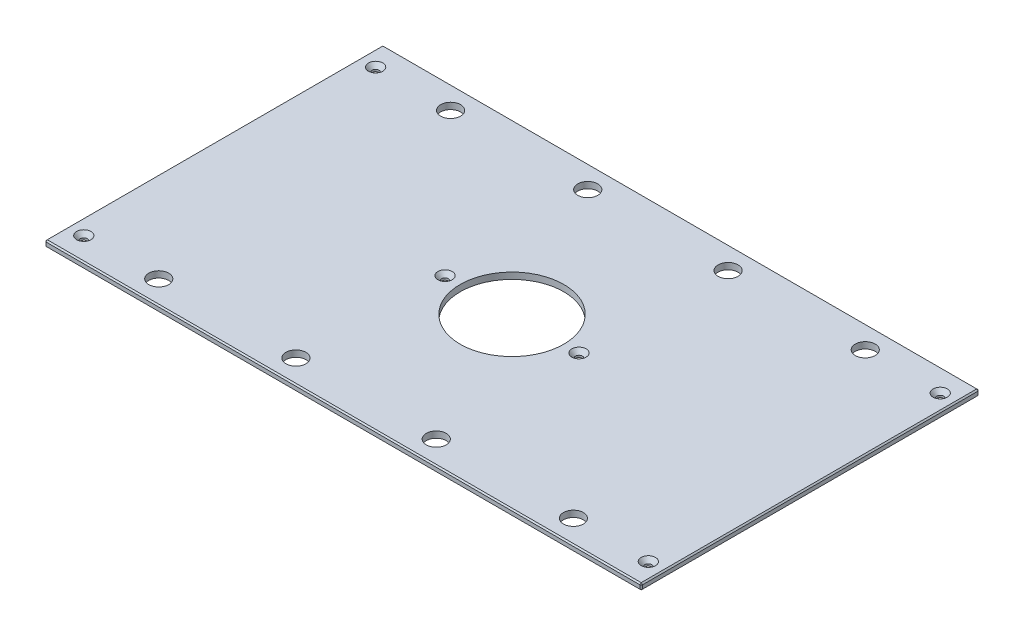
ISO-10303-21;
HEADER;
FILE_DESCRIPTION(('STEP AP214'),'2;1');
FILE_NAME('part.step','',(''),(''),'','','');
FILE_SCHEMA(('AUTOMOTIVE_DESIGN { 1 0 10303 214 1 1 1 1 }'));
ENDSEC;
DATA;
#1=APPLICATION_CONTEXT('core data for automotive mechanical design processes');
#2=APPLICATION_PROTOCOL_DEFINITION('international standard','automotive_design',2000,#1);
#3=PRODUCT_CONTEXT('',#1,'mechanical');
#4=PRODUCT('Part','Part','',(#3));
#5=PRODUCT_RELATED_PRODUCT_CATEGORY('part','',(#4));
#6=PRODUCT_DEFINITION_FORMATION('','',#4);
#7=PRODUCT_DEFINITION_CONTEXT('part definition',#1,'design');
#8=PRODUCT_DEFINITION('design','',#6,#7);
#9=PRODUCT_DEFINITION_SHAPE('','',#8);
#10=(LENGTH_UNIT() NAMED_UNIT(*) SI_UNIT(.MILLI.,.METRE.));
#11=(NAMED_UNIT(*) PLANE_ANGLE_UNIT() SI_UNIT($,.RADIAN.));
#12=(NAMED_UNIT(*) SI_UNIT($,.STERADIAN.) SOLID_ANGLE_UNIT());
#13=UNCERTAINTY_MEASURE_WITH_UNIT(LENGTH_MEASURE(1.E-05),#10,'distance_accuracy_value','');
#14=(GEOMETRIC_REPRESENTATION_CONTEXT(3) GLOBAL_UNCERTAINTY_ASSIGNED_CONTEXT((#13)) GLOBAL_UNIT_ASSIGNED_CONTEXT((#10,
#11,#12)) REPRESENTATION_CONTEXT('',''));
#15=CARTESIAN_POINT('',(0.,0.,0.));
#16=DIRECTION('',(0.,0.,1.));
#17=DIRECTION('',(1.,0.,0.));
#18=AXIS2_PLACEMENT_3D('',#15,#16,#17);
#19=CARTESIAN_POINT('',(-296.8625,6.35,-168.275));
#20=DIRECTION('',(1.,0.,0.));
#21=DIRECTION('',(0.,0.,-1.));
#22=AXIS2_PLACEMENT_3D('',#19,#20,#21);
#23=PLANE('',#22);
#24=DIRECTION('',(0.,0.,-1.));
#25=VECTOR('',#24,1.);
#26=CARTESIAN_POINT('',(-296.8625,5.08000000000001,-168.275));
#27=LINE('',#26,#25);
#28=CARTESIAN_POINT('',(-296.8625,5.08000000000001,167.005));
#29=VERTEX_POINT('',#28);
#30=CARTESIAN_POINT('',(-296.8625,5.08000000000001,-167.005));
#31=VERTEX_POINT('',#30);
#32=EDGE_CURVE('E135',#29,#31,#27,.T.);
#33=ORIENTED_EDGE('',*,*,#32,.T.);
#34=DIRECTION('',(0.,-1.,0.));
#35=VECTOR('',#34,1.);
#36=CARTESIAN_POINT('',(-296.8625,6.35,-167.005));
#37=LINE('',#36,#35);
#38=CARTESIAN_POINT('',(-296.8625,1.26999999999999,-167.005));
#39=VERTEX_POINT('',#38);
#40=EDGE_CURVE('E131',#31,#39,#37,.T.);
#41=ORIENTED_EDGE('',*,*,#40,.T.);
#42=DIRECTION('',(0.,0.,1.));
#43=VECTOR('',#42,1.);
#44=CARTESIAN_POINT('',(-296.8625,1.26999999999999,-168.275));
#45=LINE('',#44,#43);
#46=CARTESIAN_POINT('',(-296.8625,1.26999999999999,167.005));
#47=VERTEX_POINT('',#46);
#48=EDGE_CURVE('E126',#39,#47,#45,.T.);
#49=ORIENTED_EDGE('',*,*,#48,.T.);
#50=DIRECTION('',(0.,1.,0.));
#51=VECTOR('',#50,1.);
#52=CARTESIAN_POINT('',(-296.8625,6.35,167.005));
#53=LINE('',#52,#51);
#54=EDGE_CURVE('E128',#47,#29,#53,.T.);
#55=ORIENTED_EDGE('',*,*,#54,.T.);
#56=EDGE_LOOP('',(#33,#41,#49,#55));
#57=FACE_BOUND('',#56,.T.);
#58=ADVANCED_FACE('F35',(#57),#23,.F.);
#59=CARTESIAN_POINT('',(-296.8625,6.35,168.275));
#60=DIRECTION('',(0.,0.,-1.));
#61=DIRECTION('',(-1.,0.,0.));
#62=AXIS2_PLACEMENT_3D('',#59,#60,#61);
#63=PLANE('',#62);
#64=DIRECTION('',(1.,0.,0.));
#65=VECTOR('',#64,1.);
#66=CARTESIAN_POINT('',(-296.8625,1.26999999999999,168.275));
#67=LINE('',#66,#65);
#68=CARTESIAN_POINT('',(-295.5925,1.26999999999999,168.275));
#69=VERTEX_POINT('',#68);
#70=CARTESIAN_POINT('',(295.5925,1.26999999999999,168.275));
#71=VERTEX_POINT('',#70);
#72=EDGE_CURVE('E58',#69,#71,#67,.T.);
#73=ORIENTED_EDGE('',*,*,#72,.T.);
#74=DIRECTION('',(0.,1.,0.));
#75=VECTOR('',#74,1.);
#76=CARTESIAN_POINT('',(295.5925,6.35,168.275));
#77=LINE('',#76,#75);
#78=CARTESIAN_POINT('',(295.5925,5.08000000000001,168.275));
#79=VERTEX_POINT('',#78);
#80=EDGE_CURVE('E11',#71,#79,#77,.T.);
#81=ORIENTED_EDGE('',*,*,#80,.T.);
#82=DIRECTION('',(-1.,0.,0.));
#83=VECTOR('',#82,1.);
#84=CARTESIAN_POINT('',(-296.8625,5.08000000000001,168.275));
#85=LINE('',#84,#83);
#86=CARTESIAN_POINT('',(-295.5925,5.08000000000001,168.275));
#87=VERTEX_POINT('',#86);
#88=EDGE_CURVE('E44',#79,#87,#85,.T.);
#89=ORIENTED_EDGE('',*,*,#88,.T.);
#90=DIRECTION('',(0.,-1.,0.));
#91=VECTOR('',#90,1.);
#92=CARTESIAN_POINT('',(-295.5925,6.35,168.275));
#93=LINE('',#92,#91);
#94=EDGE_CURVE('E303',#87,#69,#93,.T.);
#95=ORIENTED_EDGE('',*,*,#94,.T.);
#96=EDGE_LOOP('',(#73,#81,#89,#95));
#97=FACE_BOUND('',#96,.T.);
#98=ADVANCED_FACE('F372',(#97),#63,.F.);
#99=CARTESIAN_POINT('',(296.8625,6.35,-168.275));
#100=DIRECTION('',(-1.,0.,0.));
#101=DIRECTION('',(0.,0.,1.));
#102=AXIS2_PLACEMENT_3D('',#99,#100,#101);
#103=PLANE('',#102);
#104=DIRECTION('',(0.,0.,-1.));
#105=VECTOR('',#104,1.);
#106=CARTESIAN_POINT('',(296.8625,1.26999999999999,-168.275));
#107=LINE('',#106,#105);
#108=CARTESIAN_POINT('',(296.8625,1.26999999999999,167.005));
#109=VERTEX_POINT('',#108);
#110=CARTESIAN_POINT('',(296.8625,1.26999999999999,-167.005));
#111=VERTEX_POINT('',#110);
#112=EDGE_CURVE('E298',#109,#111,#107,.T.);
#113=ORIENTED_EDGE('',*,*,#112,.T.);
#114=DIRECTION('',(0.,1.,0.));
#115=VECTOR('',#114,1.);
#116=CARTESIAN_POINT('',(296.8625,6.35,-167.005));
#117=LINE('',#116,#115);
#118=CARTESIAN_POINT('',(296.8625,5.08000000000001,-167.005));
#119=VERTEX_POINT('',#118);
#120=EDGE_CURVE('E300',#111,#119,#117,.T.);
#121=ORIENTED_EDGE('',*,*,#120,.T.);
#122=DIRECTION('',(0.,0.,1.));
#123=VECTOR('',#122,1.);
#124=CARTESIAN_POINT('',(296.8625,5.08000000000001,168.275));
#125=LINE('',#124,#123);
#126=CARTESIAN_POINT('',(296.8625,5.08000000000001,167.005));
#127=VERTEX_POINT('',#126);
#128=EDGE_CURVE('E296',#119,#127,#125,.T.);
#129=ORIENTED_EDGE('',*,*,#128,.T.);
#130=DIRECTION('',(0.,-1.,0.));
#131=VECTOR('',#130,1.);
#132=CARTESIAN_POINT('',(296.8625,6.35,167.005));
#133=LINE('',#132,#131);
#134=EDGE_CURVE('E294',#127,#109,#133,.T.);
#135=ORIENTED_EDGE('',*,*,#134,.T.);
#136=EDGE_LOOP('',(#113,#121,#129,#135));
#137=FACE_BOUND('',#136,.T.);
#138=ADVANCED_FACE('F359',(#137),#103,.F.);
#139=CARTESIAN_POINT('',(-296.8625,6.35,-168.275));
#140=DIRECTION('',(0.,0.,1.));
#141=DIRECTION('',(1.,0.,0.));
#142=AXIS2_PLACEMENT_3D('',#139,#140,#141);
#143=PLANE('',#142);
#144=DIRECTION('',(-1.,0.,0.));
#145=VECTOR('',#144,1.);
#146=CARTESIAN_POINT('',(-296.8625,1.26999999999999,-168.275));
#147=LINE('',#146,#145);
#148=CARTESIAN_POINT('',(295.5925,1.26999999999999,-168.275));
#149=VERTEX_POINT('',#148);
#150=CARTESIAN_POINT('',(-295.5925,1.26999999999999,-168.275));
#151=VERTEX_POINT('',#150);
#152=EDGE_CURVE('E270',#149,#151,#147,.T.);
#153=ORIENTED_EDGE('',*,*,#152,.T.);
#154=DIRECTION('',(0.,1.,0.));
#155=VECTOR('',#154,1.);
#156=CARTESIAN_POINT('',(-295.5925,6.35,-168.275));
#157=LINE('',#156,#155);
#158=CARTESIAN_POINT('',(-295.5925,5.08000000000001,-168.275));
#159=VERTEX_POINT('',#158);
#160=EDGE_CURVE('E274',#151,#159,#157,.T.);
#161=ORIENTED_EDGE('',*,*,#160,.T.);
#162=DIRECTION('',(1.,0.,0.));
#163=VECTOR('',#162,1.);
#164=CARTESIAN_POINT('',(296.8625,5.08000000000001,-168.275));
#165=LINE('',#164,#163);
#166=CARTESIAN_POINT('',(295.5925,5.08000000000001,-168.275));
#167=VERTEX_POINT('',#166);
#168=EDGE_CURVE('E272',#159,#167,#165,.T.);
#169=ORIENTED_EDGE('',*,*,#168,.T.);
#170=DIRECTION('',(0.,-1.,0.));
#171=VECTOR('',#170,1.);
#172=CARTESIAN_POINT('',(295.5925,6.35,-168.275));
#173=LINE('',#172,#171);
#174=EDGE_CURVE('E268',#167,#149,#173,.T.);
#175=ORIENTED_EDGE('',*,*,#174,.T.);
#176=EDGE_LOOP('',(#153,#161,#169,#175));
#177=FACE_BOUND('',#176,.T.);
#178=ADVANCED_FACE('F333',(#177),#143,.F.);
#179=CARTESIAN_POINT('',(0.,6.35,0.));
#180=DIRECTION('',(0.,1.,0.));
#181=DIRECTION('',(0.,0.,1.));
#182=AXIS2_PLACEMENT_3D('',#179,#180,#181);
#183=PLANE('',#182);
#184=CARTESIAN_POINT('',(280.9875,6.35,-145.25498));
#185=DIRECTION('',(0.,1.,0.));
#186=DIRECTION('',(0.,0.,1.));
#187=AXIS2_PLACEMENT_3D('',#184,#185,#186);
#188=CIRCLE('',#187,7.13740000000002);
#189=CARTESIAN_POINT('',(280.9875,6.35,-138.11758));
#190=VERTEX_POINT('',#189);
#191=EDGE_CURVE('E816',#190,#190,#188,.T.);
#192=ORIENTED_EDGE('',*,*,#191,.F.);
#193=EDGE_LOOP('',(#192));
#194=FACE_BOUND('',#193,.T.);
#195=CARTESIAN_POINT('',(280.9875,6.35,145.25498));
#196=DIRECTION('',(0.,1.,0.));
#197=DIRECTION('',(0.,0.,1.));
#198=AXIS2_PLACEMENT_3D('',#195,#196,#197);
#199=CIRCLE('',#198,7.13740000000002);
#200=CARTESIAN_POINT('',(280.9875,6.35,152.39238));
#201=VERTEX_POINT('',#200);
#202=EDGE_CURVE('E820',#201,#201,#199,.T.);
#203=ORIENTED_EDGE('',*,*,#202,.F.);
#204=EDGE_LOOP('',(#203));
#205=FACE_BOUND('',#204,.T.);
#206=CARTESIAN_POINT('',(-280.9875,6.35,145.25498));
#207=DIRECTION('',(0.,1.,0.));
#208=DIRECTION('',(0.,0.,1.));
#209=AXIS2_PLACEMENT_3D('',#206,#207,#208);
#210=CIRCLE('',#209,7.13740000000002);
#211=CARTESIAN_POINT('',(-280.9875,6.35,152.39238));
#212=VERTEX_POINT('',#211);
#213=EDGE_CURVE('E824',#212,#212,#210,.T.);
#214=ORIENTED_EDGE('',*,*,#213,.F.);
#215=EDGE_LOOP('',(#214));
#216=FACE_BOUND('',#215,.T.);
#217=CARTESIAN_POINT('',(-66.675,6.35,0.));
#218=DIRECTION('',(0.,1.,0.));
#219=DIRECTION('',(0.,0.,1.));
#220=AXIS2_PLACEMENT_3D('',#217,#218,#219);
#221=CIRCLE('',#220,7.1374);
#222=CARTESIAN_POINT('',(-66.675,6.35,7.1374));
#223=VERTEX_POINT('',#222);
#224=EDGE_CURVE('E828',#223,#223,#221,.T.);
#225=ORIENTED_EDGE('',*,*,#224,.F.);
#226=EDGE_LOOP('',(#225));
#227=FACE_BOUND('',#226,.T.);
#228=CARTESIAN_POINT('',(66.675,6.35,0.));
#229=DIRECTION('',(0.,1.,0.));
#230=DIRECTION('',(0.,0.,1.));
#231=AXIS2_PLACEMENT_3D('',#228,#229,#230);
#232=CIRCLE('',#231,7.1374);
#233=CARTESIAN_POINT('',(66.675,6.35,7.1374));
#234=VERTEX_POINT('',#233);
#235=EDGE_CURVE('E832',#234,#234,#232,.T.);
#236=ORIENTED_EDGE('',*,*,#235,.F.);
#237=EDGE_LOOP('',(#236));
#238=FACE_BOUND('',#237,.T.);
#239=CARTESIAN_POINT('',(-280.9875,6.35,-145.25498));
#240=DIRECTION('',(0.,1.,0.));
#241=DIRECTION('',(0.,0.,1.));
#242=AXIS2_PLACEMENT_3D('',#239,#240,#241);
#243=CIRCLE('',#242,7.13740000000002);
#244=CARTESIAN_POINT('',(-280.9875,6.35,-138.11758));
#245=VERTEX_POINT('',#244);
#246=EDGE_CURVE('E835',#245,#245,#243,.T.);
#247=ORIENTED_EDGE('',*,*,#246,.F.);
#248=EDGE_LOOP('',(#247));
#249=FACE_BOUND('',#248,.T.);
#250=DIRECTION('',(0.,0.,-1.));
#251=VECTOR('',#250,1.);
#252=CARTESIAN_POINT('',(295.5925,6.35,-168.275));
#253=LINE('',#252,#251);
#254=CARTESIAN_POINT('',(295.5925,6.35,167.005));
#255=VERTEX_POINT('',#254);
#256=CARTESIAN_POINT('',(295.5925,6.35,-167.005));
#257=VERTEX_POINT('',#256);
#258=EDGE_CURVE('E281',#255,#257,#253,.T.);
#259=ORIENTED_EDGE('',*,*,#258,.T.);
#260=DIRECTION('',(-1.,0.,0.));
#261=VECTOR('',#260,1.);
#262=CARTESIAN_POINT('',(-296.8625,6.35,-167.005));
#263=LINE('',#262,#261);
#264=CARTESIAN_POINT('',(-295.5925,6.35,-167.005));
#265=VERTEX_POINT('',#264);
#266=EDGE_CURVE('E283',#257,#265,#263,.T.);
#267=ORIENTED_EDGE('',*,*,#266,.T.);
#268=DIRECTION('',(0.,0.,1.));
#269=VECTOR('',#268,1.);
#270=CARTESIAN_POINT('',(-295.5925,6.35,168.275));
#271=LINE('',#270,#269);
#272=CARTESIAN_POINT('',(-295.5925,6.35,167.005));
#273=VERTEX_POINT('',#272);
#274=EDGE_CURVE('E279',#265,#273,#271,.T.);
#275=ORIENTED_EDGE('',*,*,#274,.T.);
#276=DIRECTION('',(1.,0.,0.));
#277=VECTOR('',#276,1.);
#278=CARTESIAN_POINT('',(296.8625,6.35,167.005));
#279=LINE('',#278,#277);
#280=EDGE_CURVE('E277',#273,#255,#279,.T.);
#281=ORIENTED_EDGE('',*,*,#280,.T.);
#282=EDGE_LOOP('',(#259,#267,#275,#281));
#283=FACE_BOUND('',#282,.T.);
#284=CARTESIAN_POINT('',(206.375,6.35,-145.25498));
#285=DIRECTION('',(0.,1.,0.));
#286=DIRECTION('',(0.,0.,1.));
#287=AXIS2_PLACEMENT_3D('',#284,#285,#286);
#288=CIRCLE('',#287,9.921875);
#289=CARTESIAN_POINT('',(206.375,6.35,-135.333105));
#290=VERTEX_POINT('',#289);
#291=EDGE_CURVE('E204',#290,#290,#288,.T.);
#292=ORIENTED_EDGE('',*,*,#291,.F.);
#293=EDGE_LOOP('',(#292));
#294=FACE_BOUND('',#293,.T.);
#295=CARTESIAN_POINT('',(-206.375,6.35,-145.25498));
#296=DIRECTION('',(0.,1.,0.));
#297=DIRECTION('',(0.,0.,1.));
#298=AXIS2_PLACEMENT_3D('',#295,#296,#297);
#299=CIRCLE('',#298,9.921875);
#300=CARTESIAN_POINT('',(-206.375,6.35,-135.333105));
#301=VERTEX_POINT('',#300);
#302=EDGE_CURVE('E214',#301,#301,#299,.T.);
#303=ORIENTED_EDGE('',*,*,#302,.F.);
#304=EDGE_LOOP('',(#303));
#305=FACE_BOUND('',#304,.T.);
#306=CARTESIAN_POINT('',(206.375,6.35,145.25498));
#307=DIRECTION('',(0.,1.,0.));
#308=DIRECTION('',(0.,0.,1.));
#309=AXIS2_PLACEMENT_3D('',#306,#307,#308);
#310=CIRCLE('',#309,9.921875);
#311=CARTESIAN_POINT('',(206.375,6.35,155.176855));
#312=VERTEX_POINT('',#311);
#313=EDGE_CURVE('E225',#312,#312,#310,.T.);
#314=ORIENTED_EDGE('',*,*,#313,.F.);
#315=EDGE_LOOP('',(#314));
#316=FACE_BOUND('',#315,.T.);
#317=CARTESIAN_POINT('',(-206.375,6.35,145.25498));
#318=DIRECTION('',(0.,1.,0.));
#319=DIRECTION('',(0.,0.,1.));
#320=AXIS2_PLACEMENT_3D('',#317,#318,#319);
#321=CIRCLE('',#320,9.921875);
#322=CARTESIAN_POINT('',(-206.375,6.35,155.176855));
#323=VERTEX_POINT('',#322);
#324=EDGE_CURVE('E231',#323,#323,#321,.T.);
#325=ORIENTED_EDGE('',*,*,#324,.F.);
#326=EDGE_LOOP('',(#325));
#327=FACE_BOUND('',#326,.T.);
#328=CARTESIAN_POINT('',(-69.85,6.35,-145.25498));
#329=DIRECTION('',(0.,1.,0.));
#330=DIRECTION('',(0.,0.,1.));
#331=AXIS2_PLACEMENT_3D('',#328,#329,#330);
#332=CIRCLE('',#331,9.921875);
#333=CARTESIAN_POINT('',(-69.85,6.35,-135.333105));
#334=VERTEX_POINT('',#333);
#335=EDGE_CURVE('E237',#334,#334,#332,.T.);
#336=ORIENTED_EDGE('',*,*,#335,.F.);
#337=EDGE_LOOP('',(#336));
#338=FACE_BOUND('',#337,.T.);
#339=CARTESIAN_POINT('',(69.85,6.35,-145.25498));
#340=DIRECTION('',(0.,1.,0.));
#341=DIRECTION('',(0.,0.,1.));
#342=AXIS2_PLACEMENT_3D('',#339,#340,#341);
#343=CIRCLE('',#342,9.921875);
#344=CARTESIAN_POINT('',(69.85,6.35,-135.333105));
#345=VERTEX_POINT('',#344);
#346=EDGE_CURVE('E243',#345,#345,#343,.T.);
#347=ORIENTED_EDGE('',*,*,#346,.F.);
#348=EDGE_LOOP('',(#347));
#349=FACE_BOUND('',#348,.T.);
#350=CARTESIAN_POINT('',(69.85,6.35,145.25498));
#351=DIRECTION('',(0.,1.,0.));
#352=DIRECTION('',(0.,0.,1.));
#353=AXIS2_PLACEMENT_3D('',#350,#351,#352);
#354=CIRCLE('',#353,9.921875);
#355=CARTESIAN_POINT('',(69.85,6.35,155.176855));
#356=VERTEX_POINT('',#355);
#357=EDGE_CURVE('E249',#356,#356,#354,.T.);
#358=ORIENTED_EDGE('',*,*,#357,.F.);
#359=EDGE_LOOP('',(#358));
#360=FACE_BOUND('',#359,.T.);
#361=CARTESIAN_POINT('',(-69.85,6.35,145.25498));
#362=DIRECTION('',(0.,1.,0.));
#363=DIRECTION('',(0.,0.,1.));
#364=AXIS2_PLACEMENT_3D('',#361,#362,#363);
#365=CIRCLE('',#364,9.921875);
#366=CARTESIAN_POINT('',(-69.85,6.35,155.176855));
#367=VERTEX_POINT('',#366);
#368=EDGE_CURVE('E255',#367,#367,#365,.T.);
#369=ORIENTED_EDGE('',*,*,#368,.F.);
#370=EDGE_LOOP('',(#369));
#371=FACE_BOUND('',#370,.T.);
#372=CARTESIAN_POINT('',(0.,6.35,0.));
#373=DIRECTION('',(0.,1.,0.));
#374=DIRECTION('',(0.,0.,1.));
#375=AXIS2_PLACEMENT_3D('',#372,#373,#374);
#376=CIRCLE('',#375,51.562);
#377=CARTESIAN_POINT('',(0.,6.35,51.562));
#378=VERTEX_POINT('',#377);
#379=EDGE_CURVE('E261',#378,#378,#376,.T.);
#380=ORIENTED_EDGE('',*,*,#379,.F.);
#381=EDGE_LOOP('',(#380));
#382=FACE_BOUND('',#381,.T.);
#383=ADVANCED_FACE('F381',(#194,#205,#216,#227,#238,#249,#283,#294,#305,#316,#327,#338,#349,
#360,#371,#382),#183,.T.);
#384=CARTESIAN_POINT('',(0.,0.,0.));
#385=DIRECTION('',(0.,1.,0.));
#386=DIRECTION('',(0.,0.,1.));
#387=AXIS2_PLACEMENT_3D('',#384,#385,#386);
#388=PLANE('',#387);
#389=CARTESIAN_POINT('',(280.9875,0.,-145.25498));
#390=DIRECTION('',(0.,1.,0.));
#391=DIRECTION('',(0.,0.,1.));
#392=AXIS2_PLACEMENT_3D('',#389,#390,#391);
#393=CIRCLE('',#392,3.3782);
#394=CARTESIAN_POINT('',(280.9875,0.,-141.87678));
#395=VERTEX_POINT('',#394);
#396=EDGE_CURVE('E869',#395,#395,#393,.T.);
#397=ORIENTED_EDGE('',*,*,#396,.T.);
#398=EDGE_LOOP('',(#397));
#399=FACE_BOUND('',#398,.T.);
#400=CARTESIAN_POINT('',(280.9875,0.,145.25498));
#401=DIRECTION('',(0.,1.,0.));
#402=DIRECTION('',(0.,0.,1.));
#403=AXIS2_PLACEMENT_3D('',#400,#401,#402);
#404=CIRCLE('',#403,3.3782);
#405=CARTESIAN_POINT('',(280.9875,0.,148.63318));
#406=VERTEX_POINT('',#405);
#407=EDGE_CURVE('E862',#406,#406,#404,.T.);
#408=ORIENTED_EDGE('',*,*,#407,.T.);
#409=EDGE_LOOP('',(#408));
#410=FACE_BOUND('',#409,.T.);
#411=CARTESIAN_POINT('',(-280.9875,0.,145.25498));
#412=DIRECTION('',(0.,1.,0.));
#413=DIRECTION('',(0.,0.,1.));
#414=AXIS2_PLACEMENT_3D('',#411,#412,#413);
#415=CIRCLE('',#414,3.3782);
#416=CARTESIAN_POINT('',(-280.9875,0.,148.63318));
#417=VERTEX_POINT('',#416);
#418=EDGE_CURVE('E855',#417,#417,#415,.T.);
#419=ORIENTED_EDGE('',*,*,#418,.T.);
#420=EDGE_LOOP('',(#419));
#421=FACE_BOUND('',#420,.T.);
#422=CARTESIAN_POINT('',(-66.675,0.,0.));
#423=DIRECTION('',(0.,1.,0.));
#424=DIRECTION('',(0.,0.,1.));
#425=AXIS2_PLACEMENT_3D('',#422,#423,#424);
#426=CIRCLE('',#425,3.3782);
#427=CARTESIAN_POINT('',(-66.675,0.,3.3782));
#428=VERTEX_POINT('',#427);
#429=EDGE_CURVE('E848',#428,#428,#426,.T.);
#430=ORIENTED_EDGE('',*,*,#429,.T.);
#431=EDGE_LOOP('',(#430));
#432=FACE_BOUND('',#431,.T.);
#433=CARTESIAN_POINT('',(66.675,0.,0.));
#434=DIRECTION('',(0.,1.,0.));
#435=DIRECTION('',(0.,0.,1.));
#436=AXIS2_PLACEMENT_3D('',#433,#434,#435);
#437=CIRCLE('',#436,3.3782);
#438=CARTESIAN_POINT('',(66.675,0.,3.3782));
#439=VERTEX_POINT('',#438);
#440=EDGE_CURVE('E838',#439,#439,#437,.T.);
#441=ORIENTED_EDGE('',*,*,#440,.T.);
#442=EDGE_LOOP('',(#441));
#443=FACE_BOUND('',#442,.T.);
#444=CARTESIAN_POINT('',(-280.9875,0.,-145.25498));
#445=DIRECTION('',(0.,1.,0.));
#446=DIRECTION('',(0.,0.,1.));
#447=AXIS2_PLACEMENT_3D('',#444,#445,#446);
#448=CIRCLE('',#447,3.3782);
#449=CARTESIAN_POINT('',(-280.9875,0.,-141.87678));
#450=VERTEX_POINT('',#449);
#451=EDGE_CURVE('E217',#450,#450,#448,.T.);
#452=ORIENTED_EDGE('',*,*,#451,.T.);
#453=EDGE_LOOP('',(#452));
#454=FACE_BOUND('',#453,.T.);
#455=DIRECTION('',(0.,0.,-1.));
#456=VECTOR('',#455,1.);
#457=CARTESIAN_POINT('',(-295.5925,0.,0.));
#458=LINE('',#457,#456);
#459=CARTESIAN_POINT('',(-295.5925,0.,167.005));
#460=VERTEX_POINT('',#459);
#461=CARTESIAN_POINT('',(-295.5925,0.,-167.005));
#462=VERTEX_POINT('',#461);
#463=EDGE_CURVE('E158',#460,#462,#458,.T.);
#464=ORIENTED_EDGE('',*,*,#463,.T.);
#465=DIRECTION('',(1.,0.,0.));
#466=VECTOR('',#465,1.);
#467=CARTESIAN_POINT('',(0.,0.,-167.005));
#468=LINE('',#467,#466);
#469=CARTESIAN_POINT('',(295.5925,0.,-167.005));
#470=VERTEX_POINT('',#469);
#471=EDGE_CURVE('E291',#462,#470,#468,.T.);
#472=ORIENTED_EDGE('',*,*,#471,.T.);
#473=DIRECTION('',(0.,0.,1.));
#474=VECTOR('',#473,1.);
#475=CARTESIAN_POINT('',(295.5925,0.,0.));
#476=LINE('',#475,#474);
#477=CARTESIAN_POINT('',(295.5925,0.,167.005));
#478=VERTEX_POINT('',#477);
#479=EDGE_CURVE('E289',#470,#478,#476,.T.);
#480=ORIENTED_EDGE('',*,*,#479,.T.);
#481=DIRECTION('',(-1.,0.,0.));
#482=VECTOR('',#481,1.);
#483=CARTESIAN_POINT('',(0.,0.,167.005));
#484=LINE('',#483,#482);
#485=EDGE_CURVE('E286',#478,#460,#484,.T.);
#486=ORIENTED_EDGE('',*,*,#485,.T.);
#487=EDGE_LOOP('',(#464,#472,#480,#486));
#488=FACE_BOUND('',#487,.T.);
#489=CARTESIAN_POINT('',(206.375,0.,-145.25498));
#490=DIRECTION('',(0.,1.,0.));
#491=DIRECTION('',(0.,0.,1.));
#492=AXIS2_PLACEMENT_3D('',#489,#490,#491);
#493=CIRCLE('',#492,9.921875);
#494=CARTESIAN_POINT('',(206.375,0.,-135.333105));
#495=VERTEX_POINT('',#494);
#496=EDGE_CURVE('E209',#495,#495,#493,.T.);
#497=ORIENTED_EDGE('',*,*,#496,.T.);
#498=EDGE_LOOP('',(#497));
#499=FACE_BOUND('',#498,.T.);
#500=CARTESIAN_POINT('',(-206.375,0.,-145.25498));
#501=DIRECTION('',(0.,1.,0.));
#502=DIRECTION('',(0.,0.,1.));
#503=AXIS2_PLACEMENT_3D('',#500,#501,#502);
#504=CIRCLE('',#503,9.921875);
#505=CARTESIAN_POINT('',(-206.375,0.,-135.333105));
#506=VERTEX_POINT('',#505);
#507=EDGE_CURVE('E222',#506,#506,#504,.T.);
#508=ORIENTED_EDGE('',*,*,#507,.T.);
#509=EDGE_LOOP('',(#508));
#510=FACE_BOUND('',#509,.T.);
#511=CARTESIAN_POINT('',(206.375,0.,145.25498));
#512=DIRECTION('',(0.,1.,0.));
#513=DIRECTION('',(0.,0.,1.));
#514=AXIS2_PLACEMENT_3D('',#511,#512,#513);
#515=CIRCLE('',#514,9.921875);
#516=CARTESIAN_POINT('',(206.375,0.,155.176855));
#517=VERTEX_POINT('',#516);
#518=EDGE_CURVE('E228',#517,#517,#515,.T.);
#519=ORIENTED_EDGE('',*,*,#518,.T.);
#520=EDGE_LOOP('',(#519));
#521=FACE_BOUND('',#520,.T.);
#522=CARTESIAN_POINT('',(-206.375,0.,145.25498));
#523=DIRECTION('',(0.,1.,0.));
#524=DIRECTION('',(0.,0.,1.));
#525=AXIS2_PLACEMENT_3D('',#522,#523,#524);
#526=CIRCLE('',#525,9.921875);
#527=CARTESIAN_POINT('',(-206.375,0.,155.176855));
#528=VERTEX_POINT('',#527);
#529=EDGE_CURVE('E234',#528,#528,#526,.T.);
#530=ORIENTED_EDGE('',*,*,#529,.T.);
#531=EDGE_LOOP('',(#530));
#532=FACE_BOUND('',#531,.T.);
#533=CARTESIAN_POINT('',(-69.85,0.,-145.25498));
#534=DIRECTION('',(0.,1.,0.));
#535=DIRECTION('',(0.,0.,1.));
#536=AXIS2_PLACEMENT_3D('',#533,#534,#535);
#537=CIRCLE('',#536,9.921875);
#538=CARTESIAN_POINT('',(-69.85,0.,-135.333105));
#539=VERTEX_POINT('',#538);
#540=EDGE_CURVE('E240',#539,#539,#537,.T.);
#541=ORIENTED_EDGE('',*,*,#540,.T.);
#542=EDGE_LOOP('',(#541));
#543=FACE_BOUND('',#542,.T.);
#544=CARTESIAN_POINT('',(69.85,0.,-145.25498));
#545=DIRECTION('',(0.,1.,0.));
#546=DIRECTION('',(0.,0.,1.));
#547=AXIS2_PLACEMENT_3D('',#544,#545,#546);
#548=CIRCLE('',#547,9.921875);
#549=CARTESIAN_POINT('',(69.85,0.,-135.333105));
#550=VERTEX_POINT('',#549);
#551=EDGE_CURVE('E246',#550,#550,#548,.T.);
#552=ORIENTED_EDGE('',*,*,#551,.T.);
#553=EDGE_LOOP('',(#552));
#554=FACE_BOUND('',#553,.T.);
#555=CARTESIAN_POINT('',(69.85,0.,145.25498));
#556=DIRECTION('',(0.,1.,0.));
#557=DIRECTION('',(0.,0.,1.));
#558=AXIS2_PLACEMENT_3D('',#555,#556,#557);
#559=CIRCLE('',#558,9.921875);
#560=CARTESIAN_POINT('',(69.85,0.,155.176855));
#561=VERTEX_POINT('',#560);
#562=EDGE_CURVE('E252',#561,#561,#559,.T.);
#563=ORIENTED_EDGE('',*,*,#562,.T.);
#564=EDGE_LOOP('',(#563));
#565=FACE_BOUND('',#564,.T.);
#566=CARTESIAN_POINT('',(-69.85,0.,145.25498));
#567=DIRECTION('',(0.,1.,0.));
#568=DIRECTION('',(0.,0.,1.));
#569=AXIS2_PLACEMENT_3D('',#566,#567,#568);
#570=CIRCLE('',#569,9.921875);
#571=CARTESIAN_POINT('',(-69.85,0.,155.176855));
#572=VERTEX_POINT('',#571);
#573=EDGE_CURVE('E258',#572,#572,#570,.T.);
#574=ORIENTED_EDGE('',*,*,#573,.T.);
#575=EDGE_LOOP('',(#574));
#576=FACE_BOUND('',#575,.T.);
#577=CARTESIAN_POINT('',(0.,0.,0.));
#578=DIRECTION('',(0.,1.,0.));
#579=DIRECTION('',(0.,0.,1.));
#580=AXIS2_PLACEMENT_3D('',#577,#578,#579);
#581=CIRCLE('',#580,51.562);
#582=CARTESIAN_POINT('',(0.,0.,51.562));
#583=VERTEX_POINT('',#582);
#584=EDGE_CURVE('E147',#583,#583,#581,.T.);
#585=ORIENTED_EDGE('',*,*,#584,.T.);
#586=EDGE_LOOP('',(#585));
#587=FACE_BOUND('',#586,.T.);
#588=ADVANCED_FACE('F346',(#399,#410,#421,#432,#443,#454,#488,#499,#510,#521,#532,#543,#554,
#565,#576,#587),#388,.F.);
#589=CARTESIAN_POINT('',(0.,0.,0.));
#590=DIRECTION('',(0.,1.,0.));
#591=DIRECTION('',(0.,0.,1.));
#592=AXIS2_PLACEMENT_3D('',#589,#590,#591);
#593=CYLINDRICAL_SURFACE('',#592,51.562);
#594=ORIENTED_EDGE('',*,*,#584,.F.);
#595=EDGE_LOOP('',(#594));
#596=FACE_BOUND('',#595,.T.);
#597=ORIENTED_EDGE('',*,*,#379,.T.);
#598=EDGE_LOOP('',(#597));
#599=FACE_BOUND('',#598,.T.);
#600=ADVANCED_FACE('F751',(#596,#599),#593,.F.);
#601=CARTESIAN_POINT('',(-69.85,6.35,145.25498));
#602=DIRECTION('',(0.,1.,0.));
#603=DIRECTION('',(0.,0.,1.));
#604=AXIS2_PLACEMENT_3D('',#601,#602,#603);
#605=CYLINDRICAL_SURFACE('',#604,9.921875);
#606=ORIENTED_EDGE('',*,*,#573,.F.);
#607=EDGE_LOOP('',(#606));
#608=FACE_BOUND('',#607,.T.);
#609=ORIENTED_EDGE('',*,*,#368,.T.);
#610=EDGE_LOOP('',(#609));
#611=FACE_BOUND('',#610,.T.);
#612=ADVANCED_FACE('F742',(#608,#611),#605,.F.);
#613=CARTESIAN_POINT('',(69.85,6.35,145.25498));
#614=DIRECTION('',(0.,1.,0.));
#615=DIRECTION('',(0.,0.,1.));
#616=AXIS2_PLACEMENT_3D('',#613,#614,#615);
#617=CYLINDRICAL_SURFACE('',#616,9.921875);
#618=ORIENTED_EDGE('',*,*,#562,.F.);
#619=EDGE_LOOP('',(#618));
#620=FACE_BOUND('',#619,.T.);
#621=ORIENTED_EDGE('',*,*,#357,.T.);
#622=EDGE_LOOP('',(#621));
#623=FACE_BOUND('',#622,.T.);
#624=ADVANCED_FACE('F733',(#620,#623),#617,.F.);
#625=CARTESIAN_POINT('',(69.85,6.35,-145.25498));
#626=DIRECTION('',(0.,1.,0.));
#627=DIRECTION('',(0.,0.,1.));
#628=AXIS2_PLACEMENT_3D('',#625,#626,#627);
#629=CYLINDRICAL_SURFACE('',#628,9.921875);
#630=ORIENTED_EDGE('',*,*,#551,.F.);
#631=EDGE_LOOP('',(#630));
#632=FACE_BOUND('',#631,.T.);
#633=ORIENTED_EDGE('',*,*,#346,.T.);
#634=EDGE_LOOP('',(#633));
#635=FACE_BOUND('',#634,.T.);
#636=ADVANCED_FACE('F724',(#632,#635),#629,.F.);
#637=CARTESIAN_POINT('',(-69.85,6.35,-145.25498));
#638=DIRECTION('',(0.,1.,0.));
#639=DIRECTION('',(0.,0.,1.));
#640=AXIS2_PLACEMENT_3D('',#637,#638,#639);
#641=CYLINDRICAL_SURFACE('',#640,9.921875);
#642=ORIENTED_EDGE('',*,*,#540,.F.);
#643=EDGE_LOOP('',(#642));
#644=FACE_BOUND('',#643,.T.);
#645=ORIENTED_EDGE('',*,*,#335,.T.);
#646=EDGE_LOOP('',(#645));
#647=FACE_BOUND('',#646,.T.);
#648=ADVANCED_FACE('F715',(#644,#647),#641,.F.);
#649=CARTESIAN_POINT('',(-206.375,6.35,145.25498));
#650=DIRECTION('',(0.,1.,0.));
#651=DIRECTION('',(0.,0.,1.));
#652=AXIS2_PLACEMENT_3D('',#649,#650,#651);
#653=CYLINDRICAL_SURFACE('',#652,9.921875);
#654=ORIENTED_EDGE('',*,*,#529,.F.);
#655=EDGE_LOOP('',(#654));
#656=FACE_BOUND('',#655,.T.);
#657=ORIENTED_EDGE('',*,*,#324,.T.);
#658=EDGE_LOOP('',(#657));
#659=FACE_BOUND('',#658,.T.);
#660=ADVANCED_FACE('F706',(#656,#659),#653,.F.);
#661=CARTESIAN_POINT('',(206.375,6.35,145.25498));
#662=DIRECTION('',(0.,1.,0.));
#663=DIRECTION('',(0.,0.,1.));
#664=AXIS2_PLACEMENT_3D('',#661,#662,#663);
#665=CYLINDRICAL_SURFACE('',#664,9.921875);
#666=ORIENTED_EDGE('',*,*,#518,.F.);
#667=EDGE_LOOP('',(#666));
#668=FACE_BOUND('',#667,.T.);
#669=ORIENTED_EDGE('',*,*,#313,.T.);
#670=EDGE_LOOP('',(#669));
#671=FACE_BOUND('',#670,.T.);
#672=ADVANCED_FACE('F697',(#668,#671),#665,.F.);
#673=CARTESIAN_POINT('',(-206.375,6.35,-145.25498));
#674=DIRECTION('',(0.,1.,0.));
#675=DIRECTION('',(0.,0.,1.));
#676=AXIS2_PLACEMENT_3D('',#673,#674,#675);
#677=CYLINDRICAL_SURFACE('',#676,9.921875);
#678=ORIENTED_EDGE('',*,*,#507,.F.);
#679=EDGE_LOOP('',(#678));
#680=FACE_BOUND('',#679,.T.);
#681=ORIENTED_EDGE('',*,*,#302,.T.);
#682=EDGE_LOOP('',(#681));
#683=FACE_BOUND('',#682,.T.);
#684=ADVANCED_FACE('F687',(#680,#683),#677,.F.);
#685=CARTESIAN_POINT('',(206.375,6.35,-145.25498));
#686=DIRECTION('',(0.,1.,0.));
#687=DIRECTION('',(0.,0.,1.));
#688=AXIS2_PLACEMENT_3D('',#685,#686,#687);
#689=CYLINDRICAL_SURFACE('',#688,9.921875);
#690=ORIENTED_EDGE('',*,*,#496,.F.);
#691=EDGE_LOOP('',(#690));
#692=FACE_BOUND('',#691,.T.);
#693=ORIENTED_EDGE('',*,*,#291,.T.);
#694=EDGE_LOOP('',(#693));
#695=FACE_BOUND('',#694,.T.);
#696=ADVANCED_FACE('F390',(#692,#695),#689,.F.);
#697=CARTESIAN_POINT('',(296.8625,6.35,167.005));
#698=DIRECTION('',(-0.707106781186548,0.,-0.707106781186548));
#699=DIRECTION('',(0.,-1.,0.));
#700=AXIS2_PLACEMENT_3D('',#697,#698,#699);
#701=PLANE('',#700);
#702=DIRECTION('',(-0.707106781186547,0.,0.707106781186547));
#703=VECTOR('',#702,1.);
#704=CARTESIAN_POINT('',(296.8625,5.08000000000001,167.005));
#705=LINE('',#704,#703);
#706=EDGE_CURVE('E39',#79,#127,#705,.F.);
#707=ORIENTED_EDGE('',*,*,#706,.F.);
#708=ORIENTED_EDGE('',*,*,#80,.F.);
#709=DIRECTION('',(0.707106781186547,0.,-0.707106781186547));
#710=VECTOR('',#709,1.);
#711=CARTESIAN_POINT('',(296.2275,1.26999999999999,167.64));
#712=LINE('',#711,#710);
#713=EDGE_CURVE('E197',#109,#71,#712,.F.);
#714=ORIENTED_EDGE('',*,*,#713,.F.);
#715=ORIENTED_EDGE('',*,*,#134,.F.);
#716=EDGE_LOOP('',(#707,#708,#714,#715));
#717=FACE_BOUND('',#716,.T.);
#718=ADVANCED_FACE('F37',(#717),#701,.F.);
#719=CARTESIAN_POINT('',(296.8625,5.08000000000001,167.005));
#720=DIRECTION('',(0.577350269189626,0.577350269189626,0.577350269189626));
#721=DIRECTION('',(0.707106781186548,0.,-0.707106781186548));
#722=AXIS2_PLACEMENT_3D('',#719,#720,#721);
#723=PLANE('',#722);
#724=DIRECTION('',(0.,-0.707106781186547,0.707106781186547));
#725=VECTOR('',#724,1.);
#726=CARTESIAN_POINT('',(295.5925,5.715,167.64));
#727=LINE('',#726,#725);
#728=EDGE_CURVE('E193',#79,#255,#727,.F.);
#729=ORIENTED_EDGE('',*,*,#728,.F.);
#730=ORIENTED_EDGE('',*,*,#706,.T.);
#731=DIRECTION('',(-0.707106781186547,0.707106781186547,0.));
#732=VECTOR('',#731,1.);
#733=CARTESIAN_POINT('',(296.8625,5.08000000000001,167.005));
#734=LINE('',#733,#732);
#735=EDGE_CURVE('E195',#255,#127,#734,.F.);
#736=ORIENTED_EDGE('',*,*,#735,.F.);
#737=EDGE_LOOP('',(#729,#730,#736));
#738=FACE_BOUND('',#737,.T.);
#739=ADVANCED_FACE('F383',(#738),#723,.T.);
#740=CARTESIAN_POINT('',(295.5925,0.,167.005));
#741=DIRECTION('',(0.577350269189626,-0.577350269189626,0.577350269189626));
#742=DIRECTION('',(0.707106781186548,0.,-0.707106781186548));
#743=AXIS2_PLACEMENT_3D('',#740,#741,#742);
#744=PLANE('',#743);
#745=DIRECTION('',(-0.707106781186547,-0.707106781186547,0.));
#746=VECTOR('',#745,1.);
#747=CARTESIAN_POINT('',(295.5925,0.,167.005));
#748=LINE('',#747,#746);
#749=EDGE_CURVE('E187',#109,#478,#748,.T.);
#750=ORIENTED_EDGE('',*,*,#749,.F.);
#751=ORIENTED_EDGE('',*,*,#713,.T.);
#752=DIRECTION('',(0.,0.707106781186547,0.707106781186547));
#753=VECTOR('',#752,1.);
#754=CARTESIAN_POINT('',(295.5925,0.,167.005));
#755=LINE('',#754,#753);
#756=EDGE_CURVE('E190',#478,#71,#755,.T.);
#757=ORIENTED_EDGE('',*,*,#756,.F.);
#758=EDGE_LOOP('',(#750,#751,#757));
#759=FACE_BOUND('',#758,.T.);
#760=ADVANCED_FACE('F352',(#759),#744,.T.);
#761=CARTESIAN_POINT('',(295.5925,6.35,0.));
#762=DIRECTION('',(0.707106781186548,0.707106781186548,0.));
#763=DIRECTION('',(0.,0.,1.));
#764=AXIS2_PLACEMENT_3D('',#761,#762,#763);
#765=PLANE('',#764);
#766=ORIENTED_EDGE('',*,*,#735,.T.);
#767=ORIENTED_EDGE('',*,*,#128,.F.);
#768=DIRECTION('',(0.707106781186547,-0.707106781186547,0.));
#769=VECTOR('',#768,1.);
#770=CARTESIAN_POINT('',(296.2275,5.715,-167.005));
#771=LINE('',#770,#769);
#772=EDGE_CURVE('E182',#257,#119,#771,.T.);
#773=ORIENTED_EDGE('',*,*,#772,.F.);
#774=ORIENTED_EDGE('',*,*,#258,.F.);
#775=EDGE_LOOP('',(#766,#767,#773,#774));
#776=FACE_BOUND('',#775,.T.);
#777=ADVANCED_FACE('F369',(#776),#765,.T.);
#778=CARTESIAN_POINT('',(0.,6.35,167.005));
#779=DIRECTION('',(0.,0.707106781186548,0.707106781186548));
#780=DIRECTION('',(-1.,0.,0.));
#781=AXIS2_PLACEMENT_3D('',#778,#779,#780);
#782=PLANE('',#781);
#783=ORIENTED_EDGE('',*,*,#728,.T.);
#784=ORIENTED_EDGE('',*,*,#280,.F.);
#785=DIRECTION('',(0.,0.707106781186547,-0.707106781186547));
#786=VECTOR('',#785,1.);
#787=CARTESIAN_POINT('',(-295.5925,6.35,167.005));
#788=LINE('',#787,#786);
#789=EDGE_CURVE('E179',#87,#273,#788,.T.);
#790=ORIENTED_EDGE('',*,*,#789,.F.);
#791=ORIENTED_EDGE('',*,*,#88,.F.);
#792=EDGE_LOOP('',(#783,#784,#790,#791));
#793=FACE_BOUND('',#792,.T.);
#794=ADVANCED_FACE('F374',(#793),#782,.T.);
#795=CARTESIAN_POINT('',(-295.5925,6.35,168.275));
#796=DIRECTION('',(0.707106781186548,0.,-0.707106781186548));
#797=DIRECTION('',(0.,-1.,0.));
#798=AXIS2_PLACEMENT_3D('',#795,#796,#797);
#799=PLANE('',#798);
#800=DIRECTION('',(0.707106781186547,0.,0.707106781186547));
#801=VECTOR('',#800,1.);
#802=CARTESIAN_POINT('',(-296.8625,1.26999999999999,167.005));
#803=LINE('',#802,#801);
#804=EDGE_CURVE('E142',#69,#47,#803,.F.);
#805=ORIENTED_EDGE('',*,*,#804,.F.);
#806=ORIENTED_EDGE('',*,*,#94,.F.);
#807=DIRECTION('',(-0.707106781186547,0.,-0.707106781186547));
#808=VECTOR('',#807,1.);
#809=CARTESIAN_POINT('',(-296.2275,5.08000000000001,167.64));
#810=LINE('',#809,#808);
#811=EDGE_CURVE('E145',#29,#87,#810,.F.);
#812=ORIENTED_EDGE('',*,*,#811,.F.);
#813=ORIENTED_EDGE('',*,*,#54,.F.);
#814=EDGE_LOOP('',(#805,#806,#812,#813));
#815=FACE_BOUND('',#814,.T.);
#816=ADVANCED_FACE('F140',(#815),#799,.F.);
#817=CARTESIAN_POINT('',(-296.8625,1.26999999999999,168.275));
#818=DIRECTION('',(0.,0.707106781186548,-0.707106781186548));
#819=DIRECTION('',(1.,0.,0.));
#820=AXIS2_PLACEMENT_3D('',#817,#818,#819);
#821=PLANE('',#820);
#822=ORIENTED_EDGE('',*,*,#756,.T.);
#823=ORIENTED_EDGE('',*,*,#72,.F.);
#824=DIRECTION('',(0.,-0.707106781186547,-0.707106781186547));
#825=VECTOR('',#824,1.);
#826=CARTESIAN_POINT('',(-295.5925,0.634999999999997,167.64));
#827=LINE('',#826,#825);
#828=EDGE_CURVE('E155',#460,#69,#827,.F.);
#829=ORIENTED_EDGE('',*,*,#828,.F.);
#830=ORIENTED_EDGE('',*,*,#485,.F.);
#831=EDGE_LOOP('',(#822,#823,#829,#830));
#832=FACE_BOUND('',#831,.T.);
#833=ADVANCED_FACE('F351',(#832),#821,.F.);
#834=CARTESIAN_POINT('',(296.8625,1.26999999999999,-168.275));
#835=DIRECTION('',(-0.707106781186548,0.707106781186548,0.));
#836=DIRECTION('',(0.,0.,-1.));
#837=AXIS2_PLACEMENT_3D('',#834,#835,#836);
#838=PLANE('',#837);
#839=ORIENTED_EDGE('',*,*,#749,.T.);
#840=ORIENTED_EDGE('',*,*,#479,.F.);
#841=DIRECTION('',(0.707106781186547,0.707106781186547,0.));
#842=VECTOR('',#841,1.);
#843=CARTESIAN_POINT('',(295.5925,0.,-167.005));
#844=LINE('',#843,#842);
#845=EDGE_CURVE('E174',#111,#470,#844,.F.);
#846=ORIENTED_EDGE('',*,*,#845,.F.);
#847=ORIENTED_EDGE('',*,*,#112,.F.);
#848=EDGE_LOOP('',(#839,#840,#846,#847));
#849=FACE_BOUND('',#848,.T.);
#850=ADVANCED_FACE('F356',(#849),#838,.F.);
#851=CARTESIAN_POINT('',(295.5925,6.35,-168.275));
#852=DIRECTION('',(-0.707106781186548,0.,0.707106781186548));
#853=DIRECTION('',(0.,-1.,0.));
#854=AXIS2_PLACEMENT_3D('',#851,#852,#853);
#855=PLANE('',#854);
#856=DIRECTION('',(0.707106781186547,0.,0.707106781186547));
#857=VECTOR('',#856,1.);
#858=CARTESIAN_POINT('',(295.5925,5.08000000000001,-168.275));
#859=LINE('',#858,#857);
#860=EDGE_CURVE('E184',#119,#167,#859,.F.);
#861=ORIENTED_EDGE('',*,*,#860,.F.);
#862=ORIENTED_EDGE('',*,*,#120,.F.);
#863=DIRECTION('',(-0.707106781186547,0.,-0.707106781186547));
#864=VECTOR('',#863,1.);
#865=CARTESIAN_POINT('',(296.2275,1.26999999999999,-167.64));
#866=LINE('',#865,#864);
#867=EDGE_CURVE('E171',#149,#111,#866,.F.);
#868=ORIENTED_EDGE('',*,*,#867,.F.);
#869=ORIENTED_EDGE('',*,*,#174,.F.);
#870=EDGE_LOOP('',(#861,#862,#868,#869));
#871=FACE_BOUND('',#870,.T.);
#872=ADVANCED_FACE('F364',(#871),#855,.F.);
#873=CARTESIAN_POINT('',(295.5925,5.08000000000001,-168.275));
#874=DIRECTION('',(0.577350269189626,0.577350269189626,-0.577350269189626));
#875=DIRECTION('',(-0.707106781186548,0.,-0.707106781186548));
#876=AXIS2_PLACEMENT_3D('',#873,#874,#875);
#877=PLANE('',#876);
#878=ORIENTED_EDGE('',*,*,#772,.T.);
#879=ORIENTED_EDGE('',*,*,#860,.T.);
#880=DIRECTION('',(0.,0.707106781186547,0.707106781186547));
#881=VECTOR('',#880,1.);
#882=CARTESIAN_POINT('',(295.5925,5.08000000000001,-168.275));
#883=LINE('',#882,#881);
#884=EDGE_CURVE('E163',#257,#167,#883,.F.);
#885=ORIENTED_EDGE('',*,*,#884,.F.);
#886=EDGE_LOOP('',(#878,#879,#885));
#887=FACE_BOUND('',#886,.T.);
#888=ADVANCED_FACE('F422',(#887),#877,.T.);
#889=CARTESIAN_POINT('',(-295.5925,6.35,167.005));
#890=DIRECTION('',(-0.577350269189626,0.577350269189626,0.577350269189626));
#891=DIRECTION('',(0.707106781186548,0.,0.707106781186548));
#892=AXIS2_PLACEMENT_3D('',#889,#890,#891);
#893=PLANE('',#892);
#894=ORIENTED_EDGE('',*,*,#811,.T.);
#895=ORIENTED_EDGE('',*,*,#789,.T.);
#896=DIRECTION('',(-0.707106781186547,-0.707106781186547,0.));
#897=VECTOR('',#896,1.);
#898=CARTESIAN_POINT('',(-295.5925,6.35,167.005));
#899=LINE('',#898,#897);
#900=EDGE_CURVE('E159',#29,#273,#899,.F.);
#901=ORIENTED_EDGE('',*,*,#900,.F.);
#902=EDGE_LOOP('',(#894,#895,#901));
#903=FACE_BOUND('',#902,.T.);
#904=ADVANCED_FACE('F376',(#903),#893,.T.);
#905=CARTESIAN_POINT('',(-296.8625,1.26999999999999,167.005));
#906=DIRECTION('',(-0.577350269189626,-0.577350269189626,0.577350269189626));
#907=DIRECTION('',(0.707106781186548,0.,0.707106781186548));
#908=AXIS2_PLACEMENT_3D('',#905,#906,#907);
#909=PLANE('',#908);
#910=ORIENTED_EDGE('',*,*,#828,.T.);
#911=ORIENTED_EDGE('',*,*,#804,.T.);
#912=DIRECTION('',(-0.707106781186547,0.707106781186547,0.));
#913=VECTOR('',#912,1.);
#914=CARTESIAN_POINT('',(-296.8625,1.26999999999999,167.005));
#915=LINE('',#914,#913);
#916=EDGE_CURVE('E152',#460,#47,#915,.T.);
#917=ORIENTED_EDGE('',*,*,#916,.F.);
#918=EDGE_LOOP('',(#910,#911,#917));
#919=FACE_BOUND('',#918,.T.);
#920=ADVANCED_FACE('F151',(#919),#909,.T.);
#921=CARTESIAN_POINT('',(295.5925,0.,-167.005));
#922=DIRECTION('',(0.577350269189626,-0.577350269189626,-0.577350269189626));
#923=DIRECTION('',(-0.707106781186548,0.,-0.707106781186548));
#924=AXIS2_PLACEMENT_3D('',#921,#922,#923);
#925=PLANE('',#924);
#926=ORIENTED_EDGE('',*,*,#867,.T.);
#927=ORIENTED_EDGE('',*,*,#845,.T.);
#928=DIRECTION('',(0.,-0.707106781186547,0.707106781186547));
#929=VECTOR('',#928,1.);
#930=CARTESIAN_POINT('',(295.5925,0.,-167.005));
#931=LINE('',#930,#929);
#932=EDGE_CURVE('E160',#149,#470,#931,.T.);
#933=ORIENTED_EDGE('',*,*,#932,.F.);
#934=EDGE_LOOP('',(#926,#927,#933));
#935=FACE_BOUND('',#934,.T.);
#936=ADVANCED_FACE('F414',(#935),#925,.T.);
#937=CARTESIAN_POINT('',(0.,6.35,-167.005));
#938=DIRECTION('',(0.,0.707106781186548,-0.707106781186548));
#939=DIRECTION('',(1.,0.,0.));
#940=AXIS2_PLACEMENT_3D('',#937,#938,#939);
#941=PLANE('',#940);
#942=ORIENTED_EDGE('',*,*,#884,.T.);
#943=ORIENTED_EDGE('',*,*,#168,.F.);
#944=DIRECTION('',(0.,-0.707106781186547,-0.707106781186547));
#945=VECTOR('',#944,1.);
#946=CARTESIAN_POINT('',(-295.5925,5.08000000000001,-168.275));
#947=LINE('',#946,#945);
#948=EDGE_CURVE('E165',#265,#159,#947,.T.);
#949=ORIENTED_EDGE('',*,*,#948,.F.);
#950=ORIENTED_EDGE('',*,*,#266,.F.);
#951=EDGE_LOOP('',(#942,#943,#949,#950));
#952=FACE_BOUND('',#951,.T.);
#953=ADVANCED_FACE('F328',(#952),#941,.T.);
#954=CARTESIAN_POINT('',(-295.5925,6.35,0.));
#955=DIRECTION('',(-0.707106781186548,0.707106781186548,0.));
#956=DIRECTION('',(0.,0.,-1.));
#957=AXIS2_PLACEMENT_3D('',#954,#955,#956);
#958=PLANE('',#957);
#959=ORIENTED_EDGE('',*,*,#900,.T.);
#960=ORIENTED_EDGE('',*,*,#274,.F.);
#961=DIRECTION('',(0.707106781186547,0.707106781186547,0.));
#962=VECTOR('',#961,1.);
#963=CARTESIAN_POINT('',(-296.2275,5.715,-167.005));
#964=LINE('',#963,#962);
#965=EDGE_CURVE('E317',#31,#265,#964,.T.);
#966=ORIENTED_EDGE('',*,*,#965,.F.);
#967=ORIENTED_EDGE('',*,*,#32,.F.);
#968=EDGE_LOOP('',(#959,#960,#966,#967));
#969=FACE_BOUND('',#968,.T.);
#970=ADVANCED_FACE('F379',(#969),#958,.T.);
#971=CARTESIAN_POINT('',(-296.8625,1.26999999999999,-168.275));
#972=DIRECTION('',(0.707106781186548,0.707106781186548,0.));
#973=DIRECTION('',(0.,0.,1.));
#974=AXIS2_PLACEMENT_3D('',#971,#972,#973);
#975=PLANE('',#974);
#976=ORIENTED_EDGE('',*,*,#916,.T.);
#977=ORIENTED_EDGE('',*,*,#48,.F.);
#978=DIRECTION('',(0.707106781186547,-0.707106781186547,0.));
#979=VECTOR('',#978,1.);
#980=CARTESIAN_POINT('',(-296.8625,1.26999999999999,-167.005));
#981=LINE('',#980,#979);
#982=EDGE_CURVE('E314',#462,#39,#981,.F.);
#983=ORIENTED_EDGE('',*,*,#982,.F.);
#984=ORIENTED_EDGE('',*,*,#463,.F.);
#985=EDGE_LOOP('',(#976,#977,#983,#984));
#986=FACE_BOUND('',#985,.T.);
#987=ADVANCED_FACE('F157',(#986),#975,.F.);
#988=CARTESIAN_POINT('',(-296.8625,1.26999999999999,-168.275));
#989=DIRECTION('',(0.,0.707106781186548,0.707106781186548));
#990=DIRECTION('',(-1.,0.,0.));
#991=AXIS2_PLACEMENT_3D('',#988,#989,#990);
#992=PLANE('',#991);
#993=ORIENTED_EDGE('',*,*,#932,.T.);
#994=ORIENTED_EDGE('',*,*,#471,.F.);
#995=DIRECTION('',(0.,0.707106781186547,-0.707106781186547));
#996=VECTOR('',#995,1.);
#997=CARTESIAN_POINT('',(-295.5925,0.634999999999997,-167.64));
#998=LINE('',#997,#996);
#999=EDGE_CURVE('E311',#151,#462,#998,.F.);
#1000=ORIENTED_EDGE('',*,*,#999,.F.);
#1001=ORIENTED_EDGE('',*,*,#152,.F.);
#1002=EDGE_LOOP('',(#993,#994,#1000,#1001));
#1003=FACE_BOUND('',#1002,.T.);
#1004=ADVANCED_FACE('F343',(#1003),#992,.F.);
#1005=CARTESIAN_POINT('',(-295.5925,5.08000000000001,-168.275));
#1006=DIRECTION('',(-0.577350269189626,0.577350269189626,-0.577350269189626));
#1007=DIRECTION('',(-0.707106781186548,0.,0.707106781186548));
#1008=AXIS2_PLACEMENT_3D('',#1005,#1006,#1007);
#1009=PLANE('',#1008);
#1010=ORIENTED_EDGE('',*,*,#965,.T.);
#1011=ORIENTED_EDGE('',*,*,#948,.T.);
#1012=DIRECTION('',(0.707106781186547,0.,-0.707106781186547));
#1013=VECTOR('',#1012,1.);
#1014=CARTESIAN_POINT('',(-295.5925,5.08000000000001,-168.275));
#1015=LINE('',#1014,#1013);
#1016=EDGE_CURVE('E309',#31,#159,#1015,.T.);
#1017=ORIENTED_EDGE('',*,*,#1016,.F.);
#1018=EDGE_LOOP('',(#1010,#1011,#1017));
#1019=FACE_BOUND('',#1018,.T.);
#1020=ADVANCED_FACE('F323',(#1019),#1009,.T.);
#1021=CARTESIAN_POINT('',(-296.8625,1.26999999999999,-167.005));
#1022=DIRECTION('',(-0.577350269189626,-0.577350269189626,-0.577350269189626));
#1023=DIRECTION('',(-0.707106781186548,0.,0.707106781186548));
#1024=AXIS2_PLACEMENT_3D('',#1021,#1022,#1023);
#1025=PLANE('',#1024);
#1026=ORIENTED_EDGE('',*,*,#999,.T.);
#1027=ORIENTED_EDGE('',*,*,#982,.T.);
#1028=DIRECTION('',(-0.707106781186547,0.,0.707106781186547));
#1029=VECTOR('',#1028,1.);
#1030=CARTESIAN_POINT('',(-296.8625,1.26999999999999,-167.005));
#1031=LINE('',#1030,#1029);
#1032=EDGE_CURVE('E307',#151,#39,#1031,.T.);
#1033=ORIENTED_EDGE('',*,*,#1032,.F.);
#1034=EDGE_LOOP('',(#1026,#1027,#1033));
#1035=FACE_BOUND('',#1034,.T.);
#1036=ADVANCED_FACE('F340',(#1035),#1025,.T.);
#1037=CARTESIAN_POINT('',(-296.8625,6.35,-167.005));
#1038=DIRECTION('',(0.707106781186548,0.,0.707106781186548));
#1039=DIRECTION('',(0.,-1.,0.));
#1040=AXIS2_PLACEMENT_3D('',#1037,#1038,#1039);
#1041=PLANE('',#1040);
#1042=ORIENTED_EDGE('',*,*,#1016,.T.);
#1043=ORIENTED_EDGE('',*,*,#160,.F.);
#1044=ORIENTED_EDGE('',*,*,#1032,.T.);
#1045=ORIENTED_EDGE('',*,*,#40,.F.);
#1046=EDGE_LOOP('',(#1042,#1043,#1044,#1045));
#1047=FACE_BOUND('',#1046,.T.);
#1048=ADVANCED_FACE('F338',(#1047),#1041,.F.);
#1049=CARTESIAN_POINT('',(-280.9875,6.35,-145.25498));
#1050=DIRECTION('',(0.,1.,0.));
#1051=DIRECTION('',(0.,0.,1.));
#1052=AXIS2_PLACEMENT_3D('',#1049,#1050,#1051);
#1053=CYLINDRICAL_SURFACE('',#1052,3.3782);
#1054=ORIENTED_EDGE('',*,*,#451,.F.);
#1055=EDGE_LOOP('',(#1054));
#1056=FACE_BOUND('',#1055,.T.);
#1057=CARTESIAN_POINT('',(-280.9875,2.02553508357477,-145.25498));
#1058=DIRECTION('',(0.,1.,0.));
#1059=DIRECTION('',(0.,0.,1.));
#1060=AXIS2_PLACEMENT_3D('',#1057,#1058,#1059);
#1061=CIRCLE('',#1060,3.3782);
#1062=CARTESIAN_POINT('',(-280.9875,2.02553508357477,-141.87678));
#1063=VERTEX_POINT('',#1062);
#1064=EDGE_CURVE('E837',#1063,#1063,#1061,.T.);
#1065=ORIENTED_EDGE('',*,*,#1064,.T.);
#1066=EDGE_LOOP('',(#1065));
#1067=FACE_BOUND('',#1066,.T.);
#1068=ADVANCED_FACE('F401',(#1056,#1067),#1053,.F.);
#1069=CARTESIAN_POINT('',(-280.9875,6.35,-145.25498));
#1070=DIRECTION('',(0.,1.,0.));
#1071=DIRECTION('',(0.,0.,1.));
#1072=AXIS2_PLACEMENT_3D('',#1069,#1070,#1071);
#1073=CONICAL_SURFACE('',#1072,7.13740000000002,0.715584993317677);
#1074=ORIENTED_EDGE('',*,*,#1064,.F.);
#1075=EDGE_LOOP('',(#1074));
#1076=FACE_BOUND('',#1075,.T.);
#1077=ORIENTED_EDGE('',*,*,#246,.T.);
#1078=EDGE_LOOP('',(#1077));
#1079=FACE_BOUND('',#1078,.T.);
#1080=ADVANCED_FACE('F511',(#1076,#1079),#1073,.F.);
#1081=CARTESIAN_POINT('',(66.675,6.35,0.));
#1082=DIRECTION('',(0.,1.,0.));
#1083=DIRECTION('',(0.,0.,1.));
#1084=AXIS2_PLACEMENT_3D('',#1081,#1082,#1083);
#1085=CYLINDRICAL_SURFACE('',#1084,3.3782);
#1086=ORIENTED_EDGE('',*,*,#440,.F.);
#1087=EDGE_LOOP('',(#1086));
#1088=FACE_BOUND('',#1087,.T.);
#1089=CARTESIAN_POINT('',(66.675,2.02553508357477,0.));
#1090=DIRECTION('',(0.,1.,0.));
#1091=DIRECTION('',(0.,0.,1.));
#1092=AXIS2_PLACEMENT_3D('',#1089,#1090,#1091);
#1093=CIRCLE('',#1092,3.3782);
#1094=CARTESIAN_POINT('',(66.675,2.02553508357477,3.3782));
#1095=VERTEX_POINT('',#1094);
#1096=EDGE_CURVE('E842',#1095,#1095,#1093,.T.);
#1097=ORIENTED_EDGE('',*,*,#1096,.T.);
#1098=EDGE_LOOP('',(#1097));
#1099=FACE_BOUND('',#1098,.T.);
#1100=ADVANCED_FACE('F520',(#1088,#1099),#1085,.F.);
#1101=CARTESIAN_POINT('',(66.675,6.35,0.));
#1102=DIRECTION('',(0.,1.,0.));
#1103=DIRECTION('',(0.,0.,1.));
#1104=AXIS2_PLACEMENT_3D('',#1101,#1102,#1103);
#1105=CONICAL_SURFACE('',#1104,7.1374,0.715584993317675);
#1106=ORIENTED_EDGE('',*,*,#1096,.F.);
#1107=EDGE_LOOP('',(#1106));
#1108=FACE_BOUND('',#1107,.T.);
#1109=ORIENTED_EDGE('',*,*,#235,.T.);
#1110=EDGE_LOOP('',(#1109));
#1111=FACE_BOUND('',#1110,.T.);
#1112=ADVANCED_FACE('F528',(#1108,#1111),#1105,.F.);
#1113=CARTESIAN_POINT('',(-66.675,6.35,0.));
#1114=DIRECTION('',(0.,1.,0.));
#1115=DIRECTION('',(0.,0.,1.));
#1116=AXIS2_PLACEMENT_3D('',#1113,#1114,#1115);
#1117=CYLINDRICAL_SURFACE('',#1116,3.3782);
#1118=ORIENTED_EDGE('',*,*,#429,.F.);
#1119=EDGE_LOOP('',(#1118));
#1120=FACE_BOUND('',#1119,.T.);
#1121=CARTESIAN_POINT('',(-66.675,2.02553508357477,0.));
#1122=DIRECTION('',(0.,1.,0.));
#1123=DIRECTION('',(0.,0.,1.));
#1124=AXIS2_PLACEMENT_3D('',#1121,#1122,#1123);
#1125=CIRCLE('',#1124,3.3782);
#1126=CARTESIAN_POINT('',(-66.675,2.02553508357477,3.3782));
#1127=VERTEX_POINT('',#1126);
#1128=EDGE_CURVE('E851',#1127,#1127,#1125,.T.);
#1129=ORIENTED_EDGE('',*,*,#1128,.T.);
#1130=EDGE_LOOP('',(#1129));
#1131=FACE_BOUND('',#1130,.T.);
#1132=ADVANCED_FACE('F536',(#1120,#1131),#1117,.F.);
#1133=CARTESIAN_POINT('',(-66.675,6.35,0.));
#1134=DIRECTION('',(0.,1.,0.));
#1135=DIRECTION('',(0.,0.,1.));
#1136=AXIS2_PLACEMENT_3D('',#1133,#1134,#1135);
#1137=CONICAL_SURFACE('',#1136,7.1374,0.715584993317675);
#1138=ORIENTED_EDGE('',*,*,#1128,.F.);
#1139=EDGE_LOOP('',(#1138));
#1140=FACE_BOUND('',#1139,.T.);
#1141=ORIENTED_EDGE('',*,*,#224,.T.);
#1142=EDGE_LOOP('',(#1141));
#1143=FACE_BOUND('',#1142,.T.);
#1144=ADVANCED_FACE('F544',(#1140,#1143),#1137,.F.);
#1145=CARTESIAN_POINT('',(-280.9875,6.35,145.25498));
#1146=DIRECTION('',(0.,1.,0.));
#1147=DIRECTION('',(0.,0.,1.));
#1148=AXIS2_PLACEMENT_3D('',#1145,#1146,#1147);
#1149=CYLINDRICAL_SURFACE('',#1148,3.3782);
#1150=ORIENTED_EDGE('',*,*,#418,.F.);
#1151=EDGE_LOOP('',(#1150));
#1152=FACE_BOUND('',#1151,.T.);
#1153=CARTESIAN_POINT('',(-280.9875,2.02553508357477,145.25498));
#1154=DIRECTION('',(0.,1.,0.));
#1155=DIRECTION('',(0.,0.,1.));
#1156=AXIS2_PLACEMENT_3D('',#1153,#1154,#1155);
#1157=CIRCLE('',#1156,3.3782);
#1158=CARTESIAN_POINT('',(-280.9875,2.02553508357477,148.63318));
#1159=VERTEX_POINT('',#1158);
#1160=EDGE_CURVE('E858',#1159,#1159,#1157,.T.);
#1161=ORIENTED_EDGE('',*,*,#1160,.T.);
#1162=EDGE_LOOP('',(#1161));
#1163=FACE_BOUND('',#1162,.T.);
#1164=ADVANCED_FACE('F552',(#1152,#1163),#1149,.F.);
#1165=CARTESIAN_POINT('',(-280.9875,6.35,145.25498));
#1166=DIRECTION('',(0.,1.,0.));
#1167=DIRECTION('',(0.,0.,1.));
#1168=AXIS2_PLACEMENT_3D('',#1165,#1166,#1167);
#1169=CONICAL_SURFACE('',#1168,7.13740000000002,0.715584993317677);
#1170=ORIENTED_EDGE('',*,*,#1160,.F.);
#1171=EDGE_LOOP('',(#1170));
#1172=FACE_BOUND('',#1171,.T.);
#1173=ORIENTED_EDGE('',*,*,#213,.T.);
#1174=EDGE_LOOP('',(#1173));
#1175=FACE_BOUND('',#1174,.T.);
#1176=ADVANCED_FACE('F560',(#1172,#1175),#1169,.F.);
#1177=CARTESIAN_POINT('',(280.9875,6.35,145.25498));
#1178=DIRECTION('',(0.,1.,0.));
#1179=DIRECTION('',(0.,0.,1.));
#1180=AXIS2_PLACEMENT_3D('',#1177,#1178,#1179);
#1181=CYLINDRICAL_SURFACE('',#1180,3.3782);
#1182=ORIENTED_EDGE('',*,*,#407,.F.);
#1183=EDGE_LOOP('',(#1182));
#1184=FACE_BOUND('',#1183,.T.);
#1185=CARTESIAN_POINT('',(280.9875,2.02553508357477,145.25498));
#1186=DIRECTION('',(0.,1.,0.));
#1187=DIRECTION('',(0.,0.,1.));
#1188=AXIS2_PLACEMENT_3D('',#1185,#1186,#1187);
#1189=CIRCLE('',#1188,3.3782);
#1190=CARTESIAN_POINT('',(280.9875,2.02553508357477,148.63318));
#1191=VERTEX_POINT('',#1190);
#1192=EDGE_CURVE('E865',#1191,#1191,#1189,.T.);
#1193=ORIENTED_EDGE('',*,*,#1192,.T.);
#1194=EDGE_LOOP('',(#1193));
#1195=FACE_BOUND('',#1194,.T.);
#1196=ADVANCED_FACE('F568',(#1184,#1195),#1181,.F.);
#1197=CARTESIAN_POINT('',(280.9875,6.35,145.25498));
#1198=DIRECTION('',(0.,1.,0.));
#1199=DIRECTION('',(0.,0.,1.));
#1200=AXIS2_PLACEMENT_3D('',#1197,#1198,#1199);
#1201=CONICAL_SURFACE('',#1200,7.13740000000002,0.715584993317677);
#1202=ORIENTED_EDGE('',*,*,#1192,.F.);
#1203=EDGE_LOOP('',(#1202));
#1204=FACE_BOUND('',#1203,.T.);
#1205=ORIENTED_EDGE('',*,*,#202,.T.);
#1206=EDGE_LOOP('',(#1205));
#1207=FACE_BOUND('',#1206,.T.);
#1208=ADVANCED_FACE('F576',(#1204,#1207),#1201,.F.);
#1209=CARTESIAN_POINT('',(280.9875,6.35,-145.25498));
#1210=DIRECTION('',(0.,1.,0.));
#1211=DIRECTION('',(0.,0.,1.));
#1212=AXIS2_PLACEMENT_3D('',#1209,#1210,#1211);
#1213=CYLINDRICAL_SURFACE('',#1212,3.3782);
#1214=ORIENTED_EDGE('',*,*,#396,.F.);
#1215=EDGE_LOOP('',(#1214));
#1216=FACE_BOUND('',#1215,.T.);
#1217=CARTESIAN_POINT('',(280.9875,2.02553508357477,-145.25498));
#1218=DIRECTION('',(0.,1.,0.));
#1219=DIRECTION('',(0.,0.,1.));
#1220=AXIS2_PLACEMENT_3D('',#1217,#1218,#1219);
#1221=CIRCLE('',#1220,3.3782);
#1222=CARTESIAN_POINT('',(280.9875,2.02553508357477,-141.87678));
#1223=VERTEX_POINT('',#1222);
#1224=EDGE_CURVE('E872',#1223,#1223,#1221,.T.);
#1225=ORIENTED_EDGE('',*,*,#1224,.T.);
#1226=EDGE_LOOP('',(#1225));
#1227=FACE_BOUND('',#1226,.T.);
#1228=ADVANCED_FACE('F584',(#1216,#1227),#1213,.F.);
#1229=CARTESIAN_POINT('',(280.9875,6.35,-145.25498));
#1230=DIRECTION('',(0.,1.,0.));
#1231=DIRECTION('',(0.,0.,1.));
#1232=AXIS2_PLACEMENT_3D('',#1229,#1230,#1231);
#1233=CONICAL_SURFACE('',#1232,7.13740000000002,0.715584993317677);
#1234=ORIENTED_EDGE('',*,*,#1224,.F.);
#1235=EDGE_LOOP('',(#1234));
#1236=FACE_BOUND('',#1235,.T.);
#1237=ORIENTED_EDGE('',*,*,#191,.T.);
#1238=EDGE_LOOP('',(#1237));
#1239=FACE_BOUND('',#1238,.T.);
#1240=ADVANCED_FACE('F592',(#1236,#1239),#1233,.F.);
#1241=CLOSED_SHELL('',(#58,#98,#138,#178,#383,#588,#600,#612,#624,#636,#648,#660,#672,#684,#696,
#718,#739,#760,#777,#794,#816,#833,#850,#872,#888,#904,#920,#936,#953,#970,#987,#1004,#1020,
#1036,#1048,#1068,#1080,#1100,#1112,#1132,#1144,#1164,#1176,#1196,#1208,#1228,#1240));
#1242=MANIFOLD_SOLID_BREP('B2',#1241);
#1243=ADVANCED_BREP_SHAPE_REPRESENTATION('',(#18,#1242),#14);
#1244=SHAPE_DEFINITION_REPRESENTATION(#9,#1243);
ENDSEC;
END-ISO-10303-21;
